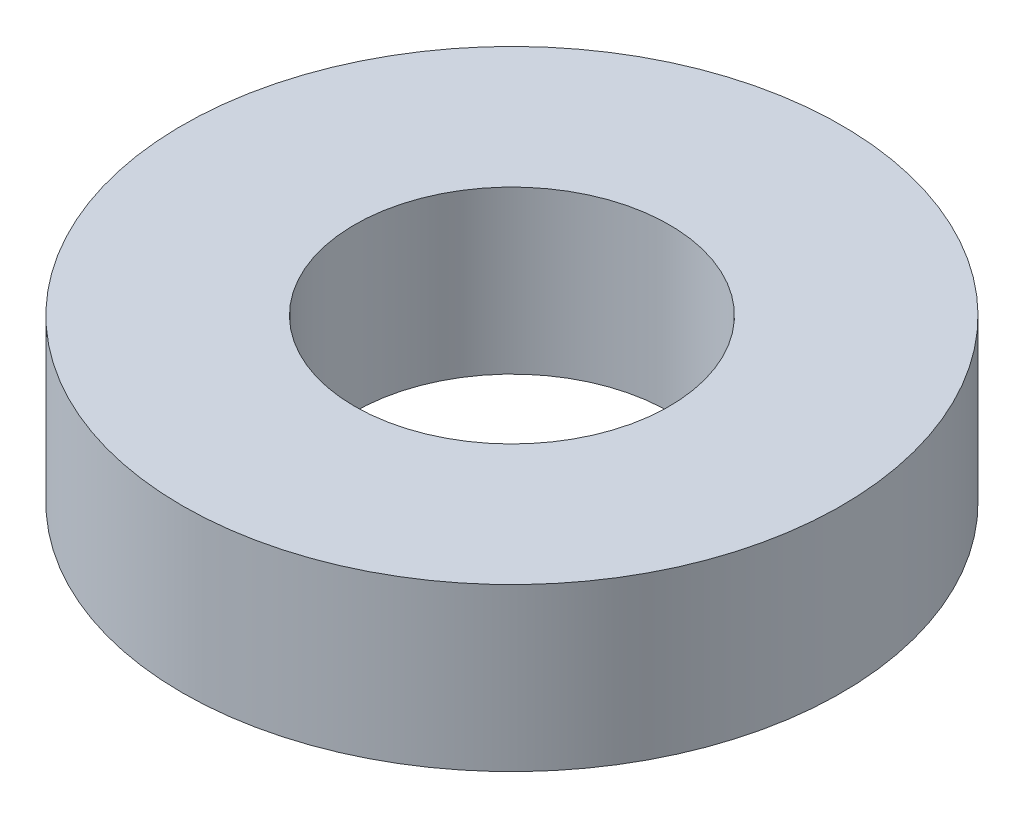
from build123d import *

# Parameters (mm, degrees)
SKETCH1_R      = 4.4958
SKETCH1_R_2    = 2.1463
EXTRUDE1_DEPTH = 2.2098


with BuildPart() as part:
    # Sketch1 → Extrude1 (new body)
    with BuildSketch(Plane(origin=(0, 0, 0), x_dir=(1, 0, 0), z_dir=(0, 1, 0))):
        with Locations(Location((0, 0, 0), (0, 0, 270))):
            Circle(SKETCH1_R)
        with Locations(Location((0, 0, 0), (0, 0, 270))):
            Circle(SKETCH1_R_2, mode=Mode.SUBTRACT)
    extrude(amount=EXTRUDE1_DEPTH)


solid = part.part
